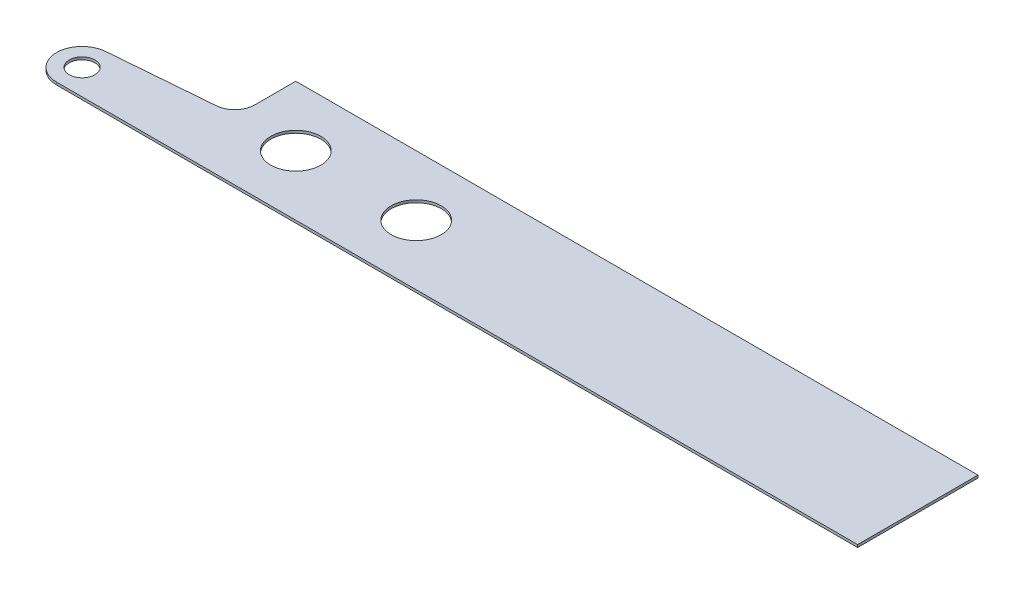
ISO-10303-21;
HEADER;
FILE_DESCRIPTION(('STEP AP214'),'2;1');
FILE_NAME('part.step','',(''),(''),'','','');
FILE_SCHEMA(('AUTOMOTIVE_DESIGN { 1 0 10303 214 1 1 1 1 }'));
ENDSEC;
DATA;
#1=APPLICATION_CONTEXT('core data for automotive mechanical design processes');
#2=APPLICATION_PROTOCOL_DEFINITION('international standard','automotive_design',2000,#1);
#3=PRODUCT_CONTEXT('',#1,'mechanical');
#4=PRODUCT('Part','Part','',(#3));
#5=PRODUCT_RELATED_PRODUCT_CATEGORY('part','',(#4));
#6=PRODUCT_DEFINITION_FORMATION('','',#4);
#7=PRODUCT_DEFINITION_CONTEXT('part definition',#1,'design');
#8=PRODUCT_DEFINITION('design','',#6,#7);
#9=PRODUCT_DEFINITION_SHAPE('','',#8);
#10=(LENGTH_UNIT() NAMED_UNIT(*) SI_UNIT(.MILLI.,.METRE.));
#11=(NAMED_UNIT(*) PLANE_ANGLE_UNIT() SI_UNIT($,.RADIAN.));
#12=(NAMED_UNIT(*) SI_UNIT($,.STERADIAN.) SOLID_ANGLE_UNIT());
#13=UNCERTAINTY_MEASURE_WITH_UNIT(LENGTH_MEASURE(1.E-05),#10,'distance_accuracy_value','');
#14=(GEOMETRIC_REPRESENTATION_CONTEXT(3) GLOBAL_UNCERTAINTY_ASSIGNED_CONTEXT((#13)) GLOBAL_UNIT_ASSIGNED_CONTEXT((#10,
#11,#12)) REPRESENTATION_CONTEXT('',''));
#15=CARTESIAN_POINT('',(0.,0.,0.));
#16=DIRECTION('',(0.,0.,1.));
#17=DIRECTION('',(1.,0.,0.));
#18=AXIS2_PLACEMENT_3D('',#15,#16,#17);
#19=CARTESIAN_POINT('',(0.,0.,0.));
#20=DIRECTION('',(0.,-1.,0.));
#21=DIRECTION('',(0.,0.,-1.));
#22=AXIS2_PLACEMENT_3D('',#19,#20,#21);
#23=PLANE('',#22);
#24=CARTESIAN_POINT('',(4.7625,0.,0.));
#25=DIRECTION('',(0.,1.,0.));
#26=DIRECTION('',(0.,0.,-1.));
#27=AXIS2_PLACEMENT_3D('',#24,#25,#26);
#28=CIRCLE('',#27,1.9812);
#29=CARTESIAN_POINT('',(4.7625,0.,-1.9812));
#30=VERTEX_POINT('',#29);
#31=EDGE_CURVE('E191',#30,#30,#28,.T.);
#32=ORIENTED_EDGE('',*,*,#31,.T.);
#33=EDGE_LOOP('',(#32));
#34=FACE_BOUND('',#33,.T.);
#35=DIRECTION('',(-1.,0.,0.));
#36=VECTOR('',#35,1.);
#37=CARTESIAN_POINT('',(-9.525,0.,-4.7625));
#38=LINE('',#37,#36);
#39=CARTESIAN_POINT('',(44.45,0.,-4.7625));
#40=VERTEX_POINT('',#39);
#41=CARTESIAN_POINT('',(-9.525,0.,-4.7625));
#42=VERTEX_POINT('',#41);
#43=EDGE_CURVE('E207',#40,#42,#38,.T.);
#44=ORIENTED_EDGE('',*,*,#43,.F.);
#45=DIRECTION('',(0.,0.,-1.));
#46=VECTOR('',#45,1.);
#47=CARTESIAN_POINT('',(44.45,0.,-4.7625));
#48=LINE('',#47,#46);
#49=CARTESIAN_POINT('',(44.45,0.,4.7625));
#50=VERTEX_POINT('',#49);
#51=EDGE_CURVE('E152',#50,#40,#48,.T.);
#52=ORIENTED_EDGE('',*,*,#51,.F.);
#53=DIRECTION('',(1.,0.,0.));
#54=VECTOR('',#53,1.);
#55=CARTESIAN_POINT('',(-9.525,0.,4.7625));
#56=LINE('',#55,#54);
#57=CARTESIAN_POINT('',(-18.9323658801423,0.,4.7625));
#58=VERTEX_POINT('',#57);
#59=EDGE_CURVE('E213',#58,#50,#56,.T.);
#60=ORIENTED_EDGE('',*,*,#59,.F.);
#61=CARTESIAN_POINT('',(-18.9323658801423,0.,2.73986588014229));
#62=DIRECTION('',(0.,1.,0.));
#63=DIRECTION('',(0.,0.,-1.));
#64=AXIS2_PLACEMENT_3D('',#61,#62,#63);
#65=CIRCLE('',#64,2.02263411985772);
#66=CARTESIAN_POINT('',(-19.0964705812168,0.,0.723900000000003));
#67=VERTEX_POINT('',#66);
#68=EDGE_CURVE('E177',#67,#58,#65,.T.);
#69=ORIENTED_EDGE('',*,*,#68,.F.);
#70=DIRECTION('',(-0.996703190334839,0.,0.0811341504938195));
#71=VECTOR('',#70,1.);
#72=CARTESIAN_POINT('',(-19.0964705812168,0.,0.723900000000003));
#73=LINE('',#72,#71);
#74=CARTESIAN_POINT('',(-10.9836995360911,0.,0.0635000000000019));
#75=VERTEX_POINT('',#74);
#76=EDGE_CURVE('E173',#75,#67,#73,.T.);
#77=ORIENTED_EDGE('',*,*,#76,.F.);
#78=CARTESIAN_POINT('',(-11.1125,0.,-1.51876631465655));
#79=DIRECTION('',(0.,-1.,0.));
#80=DIRECTION('',(0.,0.,1.));
#81=AXIS2_PLACEMENT_3D('',#78,#79,#80);
#82=CIRCLE('',#81,1.5875);
#83=CARTESIAN_POINT('',(-9.525,0.,-1.51876631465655));
#84=VERTEX_POINT('',#83);
#85=EDGE_CURVE('E170',#84,#75,#82,.T.);
#86=ORIENTED_EDGE('',*,*,#85,.F.);
#87=DIRECTION('',(0.,0.,1.));
#88=VECTOR('',#87,1.);
#89=CARTESIAN_POINT('',(-9.525,0.,4.7625));
#90=LINE('',#89,#88);
#91=EDGE_CURVE('E220',#42,#84,#90,.T.);
#92=ORIENTED_EDGE('',*,*,#91,.F.);
#93=EDGE_LOOP('',(#44,#52,#60,#69,#77,#86,#92));
#94=FACE_BOUND('',#93,.T.);
#95=CARTESIAN_POINT('',(-4.7625,0.,0.));
#96=DIRECTION('',(0.,1.,0.));
#97=DIRECTION('',(0.,0.,1.));
#98=AXIS2_PLACEMENT_3D('',#95,#96,#97);
#99=CIRCLE('',#98,1.9812);
#100=CARTESIAN_POINT('',(-4.7625,0.,1.9812));
#101=VERTEX_POINT('',#100);
#102=EDGE_CURVE('E201',#101,#101,#99,.T.);
#103=ORIENTED_EDGE('',*,*,#102,.T.);
#104=EDGE_LOOP('',(#103));
#105=FACE_BOUND('',#104,.T.);
#106=CARTESIAN_POINT('',(-18.9323658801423,0.,2.73986588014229));
#107=DIRECTION('',(0.,1.,0.));
#108=DIRECTION('',(0.,0.,1.));
#109=AXIS2_PLACEMENT_3D('',#106,#107,#108);
#110=CIRCLE('',#109,1.016);
#111=CARTESIAN_POINT('',(-18.9323658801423,0.,3.75586588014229));
#112=VERTEX_POINT('',#111);
#113=EDGE_CURVE('E164',#112,#112,#110,.T.);
#114=ORIENTED_EDGE('',*,*,#113,.T.);
#115=EDGE_LOOP('',(#114));
#116=FACE_BOUND('',#115,.T.);
#117=DIRECTION('',(-0.707106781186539,0.,0.707106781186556));
#118=VECTOR('',#117,1.);
#119=CARTESIAN_POINT('',(33.7773323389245,0.,-1.14947278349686));
#120=LINE('',#119,#118);
#121=CARTESIAN_POINT('',(33.7773323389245,0.,-1.14947278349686));
#122=VERTEX_POINT('',#121);
#123=CARTESIAN_POINT('',(33.5977272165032,0.,-0.969867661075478));
#124=VERTEX_POINT('',#123);
#125=EDGE_CURVE('E138',#122,#124,#120,.T.);
#126=ORIENTED_EDGE('',*,*,#125,.T.);
#127=DIRECTION('',(-0.707106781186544,0.,-0.707106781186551));
#128=VECTOR('',#127,1.);
#129=CARTESIAN_POINT('',(35.7170676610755,0.,1.14947278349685));
#130=LINE('',#129,#128);
#131=CARTESIAN_POINT('',(35.7170676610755,0.,1.14947278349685));
#132=VERTEX_POINT('',#131);
#133=EDGE_CURVE('E125',#132,#124,#130,.T.);
#134=ORIENTED_EDGE('',*,*,#133,.F.);
#135=DIRECTION('',(0.707106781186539,0.,-0.707106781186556));
#136=VECTOR('',#135,1.);
#137=CARTESIAN_POINT('',(35.7170676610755,0.,1.14947278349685));
#138=LINE('',#137,#136);
#139=CARTESIAN_POINT('',(35.8966727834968,0.,0.969867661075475));
#140=VERTEX_POINT('',#139);
#141=EDGE_CURVE('E130',#132,#140,#138,.T.);
#142=ORIENTED_EDGE('',*,*,#141,.T.);
#143=DIRECTION('',(-0.707106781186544,0.,-0.707106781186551));
#144=VECTOR('',#143,1.);
#145=CARTESIAN_POINT('',(35.8966727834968,0.,0.969867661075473));
#146=LINE('',#145,#144);
#147=EDGE_CURVE('E141',#140,#122,#146,.T.);
#148=ORIENTED_EDGE('',*,*,#147,.T.);
#149=EDGE_LOOP('',(#126,#134,#142,#148));
#150=FACE_BOUND('',#149,.T.);
#151=ADVANCED_FACE('F35',(#34,#94,#105,#116,#150),#23,.T.);
#152=CARTESIAN_POINT('',(-9.525,0.2032,4.7625));
#153=DIRECTION('',(1.,0.,0.));
#154=DIRECTION('',(0.,0.,-1.));
#155=AXIS2_PLACEMENT_3D('',#152,#153,#154);
#156=PLANE('',#155);
#157=DIRECTION('',(0.,1.,0.));
#158=VECTOR('',#157,1.);
#159=CARTESIAN_POINT('',(-9.525,0.,-1.51876631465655));
#160=LINE('',#159,#158);
#161=CARTESIAN_POINT('',(-9.525,0.2032,-1.51876631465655));
#162=VERTEX_POINT('',#161);
#163=EDGE_CURVE('E180',#84,#162,#160,.T.);
#164=ORIENTED_EDGE('',*,*,#163,.T.);
#165=DIRECTION('',(0.,0.,1.));
#166=VECTOR('',#165,1.);
#167=CARTESIAN_POINT('',(-9.525,0.2032,4.7625));
#168=LINE('',#167,#166);
#169=CARTESIAN_POINT('',(-9.525,0.2032,-4.7625));
#170=VERTEX_POINT('',#169);
#171=EDGE_CURVE('E212',#170,#162,#168,.T.);
#172=ORIENTED_EDGE('',*,*,#171,.F.);
#173=DIRECTION('',(0.,-1.,0.));
#174=VECTOR('',#173,1.);
#175=CARTESIAN_POINT('',(-9.525,0.2032,-4.7625));
#176=LINE('',#175,#174);
#177=EDGE_CURVE('E218',#170,#42,#176,.T.);
#178=ORIENTED_EDGE('',*,*,#177,.T.);
#179=ORIENTED_EDGE('',*,*,#91,.T.);
#180=EDGE_LOOP('',(#164,#172,#178,#179));
#181=FACE_BOUND('',#180,.T.);
#182=ADVANCED_FACE('F254',(#181),#156,.F.);
#183=CARTESIAN_POINT('',(0.,0.2032,0.));
#184=DIRECTION('',(0.,-1.,0.));
#185=DIRECTION('',(0.,0.,-1.));
#186=AXIS2_PLACEMENT_3D('',#183,#184,#185);
#187=PLANE('',#186);
#188=CARTESIAN_POINT('',(-18.9323658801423,0.2032,2.73986588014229));
#189=DIRECTION('',(0.,1.,0.));
#190=DIRECTION('',(0.,0.,1.));
#191=AXIS2_PLACEMENT_3D('',#188,#189,#190);
#192=CIRCLE('',#191,1.016);
#193=CARTESIAN_POINT('',(-18.9323658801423,0.2032,3.75586588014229));
#194=VERTEX_POINT('',#193);
#195=EDGE_CURVE('E161',#194,#194,#192,.T.);
#196=ORIENTED_EDGE('',*,*,#195,.F.);
#197=EDGE_LOOP('',(#196));
#198=FACE_BOUND('',#197,.T.);
#199=CARTESIAN_POINT('',(-4.7625,0.2032,0.));
#200=DIRECTION('',(0.,1.,0.));
#201=DIRECTION('',(0.,0.,1.));
#202=AXIS2_PLACEMENT_3D('',#199,#200,#201);
#203=CIRCLE('',#202,1.9812);
#204=CARTESIAN_POINT('',(-4.7625,0.2032,1.9812));
#205=VERTEX_POINT('',#204);
#206=EDGE_CURVE('E204',#205,#205,#203,.T.);
#207=ORIENTED_EDGE('',*,*,#206,.F.);
#208=EDGE_LOOP('',(#207));
#209=FACE_BOUND('',#208,.T.);
#210=DIRECTION('',(1.,0.,0.));
#211=VECTOR('',#210,1.);
#212=CARTESIAN_POINT('',(-9.525,0.2032,4.7625));
#213=LINE('',#212,#211);
#214=CARTESIAN_POINT('',(-18.9323658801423,0.2032,4.7625));
#215=VERTEX_POINT('',#214);
#216=CARTESIAN_POINT('',(44.45,0.2032,4.7625));
#217=VERTEX_POINT('',#216);
#218=EDGE_CURVE('E216',#215,#217,#213,.T.);
#219=ORIENTED_EDGE('',*,*,#218,.T.);
#220=DIRECTION('',(0.,0.,-1.));
#221=VECTOR('',#220,1.);
#222=CARTESIAN_POINT('',(44.45,0.2032,-4.7625));
#223=LINE('',#222,#221);
#224=CARTESIAN_POINT('',(44.45,0.2032,-4.7625));
#225=VERTEX_POINT('',#224);
#226=EDGE_CURVE('E151',#217,#225,#223,.T.);
#227=ORIENTED_EDGE('',*,*,#226,.T.);
#228=DIRECTION('',(-1.,0.,0.));
#229=VECTOR('',#228,1.);
#230=CARTESIAN_POINT('',(-9.525,0.2032,-4.7625));
#231=LINE('',#230,#229);
#232=EDGE_CURVE('E210',#225,#170,#231,.T.);
#233=ORIENTED_EDGE('',*,*,#232,.T.);
#234=ORIENTED_EDGE('',*,*,#171,.T.);
#235=CARTESIAN_POINT('',(-11.1125,0.2032,-1.51876631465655));
#236=DIRECTION('',(0.,-1.,0.));
#237=DIRECTION('',(0.,0.,1.));
#238=AXIS2_PLACEMENT_3D('',#235,#236,#237);
#239=CIRCLE('',#238,1.5875);
#240=CARTESIAN_POINT('',(-10.9836995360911,0.2032,0.0635000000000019));
#241=VERTEX_POINT('',#240);
#242=EDGE_CURVE('E167',#162,#241,#239,.T.);
#243=ORIENTED_EDGE('',*,*,#242,.T.);
#244=DIRECTION('',(-0.996703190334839,0.,0.0811341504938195));
#245=VECTOR('',#244,1.);
#246=CARTESIAN_POINT('',(-19.0964705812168,0.2032,0.723900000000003));
#247=LINE('',#246,#245);
#248=CARTESIAN_POINT('',(-19.0964705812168,0.2032,0.723900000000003));
#249=VERTEX_POINT('',#248);
#250=EDGE_CURVE('E183',#241,#249,#247,.T.);
#251=ORIENTED_EDGE('',*,*,#250,.T.);
#252=CARTESIAN_POINT('',(-18.9323658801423,0.2032,2.73986588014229));
#253=DIRECTION('',(0.,1.,0.));
#254=DIRECTION('',(0.,0.,-1.));
#255=AXIS2_PLACEMENT_3D('',#252,#253,#254);
#256=CIRCLE('',#255,2.02263411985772);
#257=EDGE_CURVE('E174',#249,#215,#256,.T.);
#258=ORIENTED_EDGE('',*,*,#257,.T.);
#259=EDGE_LOOP('',(#219,#227,#233,#234,#243,#251,#258));
#260=FACE_BOUND('',#259,.T.);
#261=CARTESIAN_POINT('',(4.7625,0.2032,0.));
#262=DIRECTION('',(0.,1.,0.));
#263=DIRECTION('',(0.,0.,-1.));
#264=AXIS2_PLACEMENT_3D('',#261,#262,#263);
#265=CIRCLE('',#264,1.9812);
#266=CARTESIAN_POINT('',(4.7625,0.2032,-1.9812));
#267=VERTEX_POINT('',#266);
#268=EDGE_CURVE('E198',#267,#267,#265,.T.);
#269=ORIENTED_EDGE('',*,*,#268,.F.);
#270=EDGE_LOOP('',(#269));
#271=FACE_BOUND('',#270,.T.);
#272=ADVANCED_FACE('F260',(#198,#209,#260,#271),#187,.F.);
#273=CARTESIAN_POINT('',(-9.525,0.2032,-4.7625));
#274=DIRECTION('',(0.,0.,1.));
#275=DIRECTION('',(1.,0.,0.));
#276=AXIS2_PLACEMENT_3D('',#273,#274,#275);
#277=PLANE('',#276);
#278=ORIENTED_EDGE('',*,*,#43,.T.);
#279=ORIENTED_EDGE('',*,*,#177,.F.);
#280=ORIENTED_EDGE('',*,*,#232,.F.);
#281=DIRECTION('',(0.,1.,0.));
#282=VECTOR('',#281,1.);
#283=CARTESIAN_POINT('',(44.45,0.,-4.7625));
#284=LINE('',#283,#282);
#285=EDGE_CURVE('E158',#40,#225,#284,.T.);
#286=ORIENTED_EDGE('',*,*,#285,.F.);
#287=EDGE_LOOP('',(#278,#279,#280,#286));
#288=FACE_BOUND('',#287,.T.);
#289=ADVANCED_FACE('F270',(#288),#277,.F.);
#290=CARTESIAN_POINT('',(-9.525,0.2032,4.7625));
#291=DIRECTION('',(0.,0.,-1.));
#292=DIRECTION('',(-1.,0.,0.));
#293=AXIS2_PLACEMENT_3D('',#290,#291,#292);
#294=PLANE('',#293);
#295=ORIENTED_EDGE('',*,*,#59,.T.);
#296=DIRECTION('',(0.,1.,0.));
#297=VECTOR('',#296,1.);
#298=CARTESIAN_POINT('',(44.45,0.,4.7625));
#299=LINE('',#298,#297);
#300=EDGE_CURVE('E155',#50,#217,#299,.T.);
#301=ORIENTED_EDGE('',*,*,#300,.T.);
#302=ORIENTED_EDGE('',*,*,#218,.F.);
#303=DIRECTION('',(0.,1.,0.));
#304=VECTOR('',#303,1.);
#305=CARTESIAN_POINT('',(-18.9323658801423,0.,4.7625));
#306=LINE('',#305,#304);
#307=EDGE_CURVE('E188',#58,#215,#306,.T.);
#308=ORIENTED_EDGE('',*,*,#307,.F.);
#309=EDGE_LOOP('',(#295,#301,#302,#308));
#310=FACE_BOUND('',#309,.T.);
#311=ADVANCED_FACE('F267',(#310),#294,.F.);
#312=CARTESIAN_POINT('',(-4.7625,0.2032,0.));
#313=DIRECTION('',(0.,-1.,0.));
#314=DIRECTION('',(0.,0.,-1.));
#315=AXIS2_PLACEMENT_3D('',#312,#313,#314);
#316=CYLINDRICAL_SURFACE('',#315,1.9812);
#317=ORIENTED_EDGE('',*,*,#206,.T.);
#318=EDGE_LOOP('',(#317));
#319=FACE_BOUND('',#318,.T.);
#320=ORIENTED_EDGE('',*,*,#102,.F.);
#321=EDGE_LOOP('',(#320));
#322=FACE_BOUND('',#321,.T.);
#323=ADVANCED_FACE('F269',(#319,#322),#316,.F.);
#324=CARTESIAN_POINT('',(4.7625,0.2032,0.));
#325=DIRECTION('',(0.,-1.,0.));
#326=DIRECTION('',(0.,0.,-1.));
#327=AXIS2_PLACEMENT_3D('',#324,#325,#326);
#328=CYLINDRICAL_SURFACE('',#327,1.9812);
#329=ORIENTED_EDGE('',*,*,#268,.T.);
#330=EDGE_LOOP('',(#329));
#331=FACE_BOUND('',#330,.T.);
#332=ORIENTED_EDGE('',*,*,#31,.F.);
#333=EDGE_LOOP('',(#332));
#334=FACE_BOUND('',#333,.T.);
#335=ADVANCED_FACE('F383',(#331,#334),#328,.F.);
#336=CARTESIAN_POINT('',(-18.9323658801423,0.,2.73986588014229));
#337=DIRECTION('',(0.,1.,0.));
#338=DIRECTION('',(0.,0.,1.));
#339=AXIS2_PLACEMENT_3D('',#336,#337,#338);
#340=CYLINDRICAL_SURFACE('',#339,2.02263411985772);
#341=ORIENTED_EDGE('',*,*,#257,.F.);
#342=DIRECTION('',(0.,1.,0.));
#343=VECTOR('',#342,1.);
#344=CARTESIAN_POINT('',(-19.0964705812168,0.,0.723900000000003));
#345=LINE('',#344,#343);
#346=EDGE_CURVE('E192',#67,#249,#345,.T.);
#347=ORIENTED_EDGE('',*,*,#346,.F.);
#348=ORIENTED_EDGE('',*,*,#68,.T.);
#349=ORIENTED_EDGE('',*,*,#307,.T.);
#350=EDGE_LOOP('',(#341,#347,#348,#349));
#351=FACE_BOUND('',#350,.T.);
#352=ADVANCED_FACE('F373',(#351),#340,.T.);
#353=CARTESIAN_POINT('',(-19.0964705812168,0.,0.723900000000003));
#354=DIRECTION('',(-0.0811341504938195,0.,-0.996703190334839));
#355=DIRECTION('',(-0.996703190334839,0.,0.0811341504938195));
#356=AXIS2_PLACEMENT_3D('',#353,#354,#355);
#357=PLANE('',#356);
#358=ORIENTED_EDGE('',*,*,#250,.F.);
#359=DIRECTION('',(0.,1.,0.));
#360=VECTOR('',#359,1.);
#361=CARTESIAN_POINT('',(-10.9836995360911,0.,0.0635000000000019));
#362=LINE('',#361,#360);
#363=EDGE_CURVE('E194',#75,#241,#362,.T.);
#364=ORIENTED_EDGE('',*,*,#363,.F.);
#365=ORIENTED_EDGE('',*,*,#76,.T.);
#366=ORIENTED_EDGE('',*,*,#346,.T.);
#367=EDGE_LOOP('',(#358,#364,#365,#366));
#368=FACE_BOUND('',#367,.T.);
#369=ADVANCED_FACE('F363',(#368),#357,.T.);
#370=CARTESIAN_POINT('',(-11.1125,0.,-1.51876631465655));
#371=DIRECTION('',(0.,1.,0.));
#372=DIRECTION('',(0.,0.,1.));
#373=AXIS2_PLACEMENT_3D('',#370,#371,#372);
#374=CYLINDRICAL_SURFACE('',#373,1.5875);
#375=ORIENTED_EDGE('',*,*,#242,.F.);
#376=ORIENTED_EDGE('',*,*,#163,.F.);
#377=ORIENTED_EDGE('',*,*,#85,.T.);
#378=ORIENTED_EDGE('',*,*,#363,.T.);
#379=EDGE_LOOP('',(#375,#376,#377,#378));
#380=FACE_BOUND('',#379,.T.);
#381=ADVANCED_FACE('F353',(#380),#374,.F.);
#382=CARTESIAN_POINT('',(-18.9323658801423,0.,2.73986588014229));
#383=DIRECTION('',(0.,1.,0.));
#384=DIRECTION('',(0.,0.,1.));
#385=AXIS2_PLACEMENT_3D('',#382,#383,#384);
#386=CYLINDRICAL_SURFACE('',#385,1.016);
#387=ORIENTED_EDGE('',*,*,#113,.F.);
#388=EDGE_LOOP('',(#387));
#389=FACE_BOUND('',#388,.T.);
#390=ORIENTED_EDGE('',*,*,#195,.T.);
#391=EDGE_LOOP('',(#390));
#392=FACE_BOUND('',#391,.T.);
#393=ADVANCED_FACE('F318',(#389,#392),#386,.F.);
#394=CARTESIAN_POINT('',(44.45,0.,-4.7625));
#395=DIRECTION('',(1.,0.,0.));
#396=DIRECTION('',(0.,0.,-1.));
#397=AXIS2_PLACEMENT_3D('',#394,#395,#396);
#398=PLANE('',#397);
#399=ORIENTED_EDGE('',*,*,#226,.F.);
#400=ORIENTED_EDGE('',*,*,#300,.F.);
#401=ORIENTED_EDGE('',*,*,#51,.T.);
#402=ORIENTED_EDGE('',*,*,#285,.T.);
#403=EDGE_LOOP('',(#399,#400,#401,#402));
#404=FACE_BOUND('',#403,.T.);
#405=ADVANCED_FACE('F303',(#404),#398,.T.);
#406=CARTESIAN_POINT('',(35.7170676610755,-0.254,1.14947278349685));
#407=DIRECTION('',(0.707106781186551,0.,-0.707106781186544));
#408=DIRECTION('',(-0.707106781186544,0.,-0.707106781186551));
#409=AXIS2_PLACEMENT_3D('',#406,#407,#408);
#410=PLANE('',#409);
#411=DIRECTION('',(0.,1.,0.));
#412=VECTOR('',#411,1.);
#413=CARTESIAN_POINT('',(33.5977272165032,-0.254,-0.969867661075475));
#414=LINE('',#413,#412);
#415=CARTESIAN_POINT('',(33.5977272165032,-0.127,-0.969867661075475));
#416=VERTEX_POINT('',#415);
#417=EDGE_CURVE('E149',#416,#124,#414,.T.);
#418=ORIENTED_EDGE('',*,*,#417,.F.);
#419=DIRECTION('',(-0.707106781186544,0.,-0.707106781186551));
#420=VECTOR('',#419,1.);
#421=CARTESIAN_POINT('',(35.7170676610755,-0.127,1.14947278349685));
#422=LINE('',#421,#420);
#423=CARTESIAN_POINT('',(35.7170676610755,-0.127,1.14947278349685));
#424=VERTEX_POINT('',#423);
#425=EDGE_CURVE('E127',#416,#424,#422,.F.);
#426=ORIENTED_EDGE('',*,*,#425,.T.);
#427=DIRECTION('',(0.,1.,0.));
#428=VECTOR('',#427,1.);
#429=CARTESIAN_POINT('',(35.7170676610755,-0.254,1.14947278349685));
#430=LINE('',#429,#428);
#431=EDGE_CURVE('E121',#424,#132,#430,.T.);
#432=ORIENTED_EDGE('',*,*,#431,.T.);
#433=ORIENTED_EDGE('',*,*,#133,.T.);
#434=EDGE_LOOP('',(#418,#426,#432,#433));
#435=FACE_BOUND('',#434,.T.);
#436=ADVANCED_FACE('F124',(#435),#410,.F.);
#437=CARTESIAN_POINT('',(33.7773323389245,-0.254,-1.14947278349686));
#438=DIRECTION('',(-0.707106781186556,0.,-0.707106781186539));
#439=DIRECTION('',(-0.707106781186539,0.,0.707106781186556));
#440=AXIS2_PLACEMENT_3D('',#437,#438,#439);
#441=PLANE('',#440);
#442=CARTESIAN_POINT('',(33.6875297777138,-0.127,-1.05967022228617));
#443=DIRECTION('',(-0.707106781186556,0.,-0.707106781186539));
#444=DIRECTION('',(-0.707106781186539,0.,0.707106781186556));
#445=AXIS2_PLACEMENT_3D('',#442,#443,#444);
#446=CIRCLE('',#445,0.127);
#447=CARTESIAN_POINT('',(33.7773323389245,-0.127,-1.14947278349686));
#448=VERTEX_POINT('',#447);
#449=CARTESIAN_POINT('',(33.6875297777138,-0.254,-1.05967022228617));
#450=VERTEX_POINT('',#449);
#451=EDGE_CURVE('E226',#448,#450,#446,.T.);
#452=ORIENTED_EDGE('',*,*,#451,.T.);
#453=CARTESIAN_POINT('',(33.6875297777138,-0.127,-1.05967022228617));
#454=DIRECTION('',(-0.707106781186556,0.,-0.707106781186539));
#455=DIRECTION('',(-0.707106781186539,0.,0.707106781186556));
#456=AXIS2_PLACEMENT_3D('',#453,#454,#455);
#457=CIRCLE('',#456,0.127);
#458=EDGE_CURVE('E228',#450,#416,#457,.T.);
#459=ORIENTED_EDGE('',*,*,#458,.T.);
#460=ORIENTED_EDGE('',*,*,#417,.T.);
#461=ORIENTED_EDGE('',*,*,#125,.F.);
#462=DIRECTION('',(0.,1.,0.));
#463=VECTOR('',#462,1.);
#464=CARTESIAN_POINT('',(33.7773323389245,-0.254,-1.14947278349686));
#465=LINE('',#464,#463);
#466=EDGE_CURVE('E147',#448,#122,#465,.T.);
#467=ORIENTED_EDGE('',*,*,#466,.F.);
#468=EDGE_LOOP('',(#452,#459,#460,#461,#467));
#469=FACE_BOUND('',#468,.T.);
#470=ADVANCED_FACE('F234',(#469),#441,.T.);
#471=CARTESIAN_POINT('',(35.8966727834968,-0.254,0.969867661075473));
#472=DIRECTION('',(0.707106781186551,0.,-0.707106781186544));
#473=DIRECTION('',(-0.707106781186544,0.,-0.707106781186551));
#474=AXIS2_PLACEMENT_3D('',#471,#472,#473);
#475=PLANE('',#474);
#476=DIRECTION('',(0.,1.,0.));
#477=VECTOR('',#476,1.);
#478=CARTESIAN_POINT('',(35.8966727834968,-0.254,0.969867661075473));
#479=LINE('',#478,#477);
#480=CARTESIAN_POINT('',(35.8966727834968,-0.127,0.969867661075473));
#481=VERTEX_POINT('',#480);
#482=EDGE_CURVE('E129',#481,#140,#479,.T.);
#483=ORIENTED_EDGE('',*,*,#482,.F.);
#484=DIRECTION('',(-0.707106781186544,0.,-0.707106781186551));
#485=VECTOR('',#484,1.);
#486=CARTESIAN_POINT('',(33.7773323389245,-0.127,-1.14947278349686));
#487=LINE('',#486,#485);
#488=EDGE_CURVE('E11',#481,#448,#487,.T.);
#489=ORIENTED_EDGE('',*,*,#488,.T.);
#490=ORIENTED_EDGE('',*,*,#466,.T.);
#491=ORIENTED_EDGE('',*,*,#147,.F.);
#492=EDGE_LOOP('',(#483,#489,#490,#491));
#493=FACE_BOUND('',#492,.T.);
#494=ADVANCED_FACE('F244',(#493),#475,.T.);
#495=CARTESIAN_POINT('',(35.7170676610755,-0.254,1.14947278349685));
#496=DIRECTION('',(0.707106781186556,0.,0.707106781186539));
#497=DIRECTION('',(0.707106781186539,0.,-0.707106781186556));
#498=AXIS2_PLACEMENT_3D('',#495,#496,#497);
#499=PLANE('',#498);
#500=ORIENTED_EDGE('',*,*,#431,.F.);
#501=CARTESIAN_POINT('',(35.8068702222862,-0.127,1.05967022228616));
#502=DIRECTION('',(0.707106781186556,0.,0.707106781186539));
#503=DIRECTION('',(0.707106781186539,0.,-0.707106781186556));
#504=AXIS2_PLACEMENT_3D('',#501,#502,#503);
#505=CIRCLE('',#504,0.127);
#506=CARTESIAN_POINT('',(35.8068702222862,-0.254,1.05967022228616));
#507=VERTEX_POINT('',#506);
#508=EDGE_CURVE('E44',#424,#507,#505,.T.);
#509=ORIENTED_EDGE('',*,*,#508,.T.);
#510=CARTESIAN_POINT('',(35.8068702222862,-0.127,1.05967022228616));
#511=DIRECTION('',(0.707106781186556,0.,0.707106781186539));
#512=DIRECTION('',(0.707106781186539,0.,-0.707106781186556));
#513=AXIS2_PLACEMENT_3D('',#510,#511,#512);
#514=CIRCLE('',#513,0.127);
#515=EDGE_CURVE('E51',#507,#481,#514,.T.);
#516=ORIENTED_EDGE('',*,*,#515,.T.);
#517=ORIENTED_EDGE('',*,*,#482,.T.);
#518=ORIENTED_EDGE('',*,*,#141,.F.);
#519=EDGE_LOOP('',(#500,#509,#516,#517,#518));
#520=FACE_BOUND('',#519,.T.);
#521=ADVANCED_FACE('F140',(#520),#499,.T.);
#522=CARTESIAN_POINT('',(35.8068702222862,-0.127,1.05967022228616));
#523=DIRECTION('',(0.707106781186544,0.,0.707106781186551));
#524=DIRECTION('',(0.707106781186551,0.,-0.707106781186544));
#525=AXIS2_PLACEMENT_3D('',#522,#523,#524);
#526=CYLINDRICAL_SURFACE('',#525,0.127);
#527=ORIENTED_EDGE('',*,*,#488,.F.);
#528=ORIENTED_EDGE('',*,*,#515,.F.);
#529=DIRECTION('',(-0.707106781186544,0.,-0.707106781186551));
#530=VECTOR('',#529,1.);
#531=CARTESIAN_POINT('',(35.8068702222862,-0.254,1.05967022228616));
#532=LINE('',#531,#530);
#533=EDGE_CURVE('E39',#450,#507,#532,.F.);
#534=ORIENTED_EDGE('',*,*,#533,.F.);
#535=ORIENTED_EDGE('',*,*,#451,.F.);
#536=EDGE_LOOP('',(#527,#528,#534,#535));
#537=FACE_BOUND('',#536,.T.);
#538=ADVANCED_FACE('F37',(#537),#526,.T.);
#539=CARTESIAN_POINT('',(17.3736000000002,-0.127,-17.3736));
#540=DIRECTION('',(-0.707106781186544,0.,-0.707106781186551));
#541=DIRECTION('',(-0.707106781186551,0.,0.707106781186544));
#542=AXIS2_PLACEMENT_3D('',#539,#540,#541);
#543=CYLINDRICAL_SURFACE('',#542,0.127);
#544=ORIENTED_EDGE('',*,*,#508,.F.);
#545=ORIENTED_EDGE('',*,*,#425,.F.);
#546=ORIENTED_EDGE('',*,*,#458,.F.);
#547=ORIENTED_EDGE('',*,*,#533,.T.);
#548=EDGE_LOOP('',(#544,#545,#546,#547));
#549=FACE_BOUND('',#548,.T.);
#550=ADVANCED_FACE('F240',(#549),#543,.T.);
#551=CLOSED_SHELL('',(#151,#182,#272,#289,#311,#323,#335,#352,#369,#381,#393,#405,#436,#470,
#494,#521,#538,#550));
#552=MANIFOLD_SOLID_BREP('B2',#551);
#553=ADVANCED_BREP_SHAPE_REPRESENTATION('',(#18,#552),#14);
#554=SHAPE_DEFINITION_REPRESENTATION(#9,#553);
ENDSEC;
END-ISO-10303-21;
